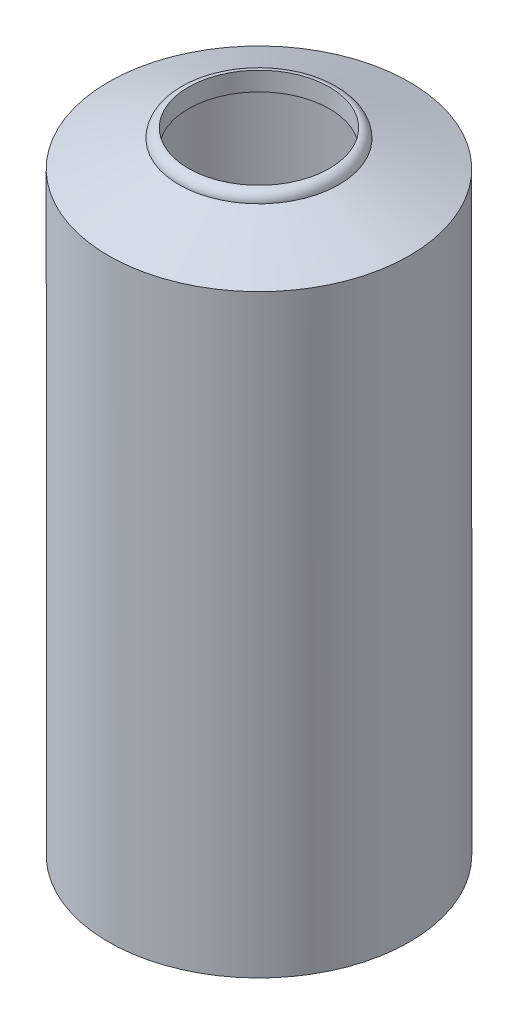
from build123d import *

# Parameters (mm, degrees)
SKETCH6_R           = 190.5
CUT_EXTRUDE1_DEPTH  = 127
SKETCH3_R           = 406.4
BOSS_EXTRUDE1_DEPTH = 25.4


with BuildPart() as part:
    # Sketch1 → Revolve1 (revolve)
    with BuildSketch(Plane.XY, mode=Mode.PRIVATE) as revolve1_sk:
        with BuildLine():
            Line((0, 0), (0, 1579.88))
            Line((0, 1579.88), (190.5, 1650.590607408))
            ThreePointArc((190.5, 1650.590607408), (197.939487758, 1668.55111965), (215.9, 1675.990607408))
            Line((215.9, 1675.990607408), (406.4, 1675.990607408))
            Line((406.4, 1675.990607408), (406.4, 1625.190607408))
            Line((406.4, 1625.190607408), (195.061974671, 1625.190607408))
            Line((195.061974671, 1625.190607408), (25.4, 1562.214747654))
            Line((25.4, 1562.214747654), (25.4, 0))
            Line((25.4, 0), (0, 0))
        make_face()
    revolve(revolve1_sk.sketch.rotate(Axis((406.4, -33.675339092, 0), (0, 1, 0)), 180), axis=Axis((406.4, -33.675339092, 0), (0, 1, 0)))

    # Sketch6 → Cut-Extrude1 (cut)
    with BuildSketch(Plane(origin=(0, 1675.990607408, 0), x_dir=(1, 0, 0), z_dir=(0, 1, 0))):
        with Locations(Location((406.4, 0, 0), (0, 0, 180))):
            Circle(SKETCH6_R)
    extrude(amount=-CUT_EXTRUDE1_DEPTH, mode=Mode.SUBTRACT)

    # Sketch3 → Boss-Extrude1 (add)
    with BuildSketch(Plane.XZ):
        with Locations((406.4, 0)):
            Circle(SKETCH3_R)
    extrude(amount=BOSS_EXTRUDE1_DEPTH)


solid = part.part
